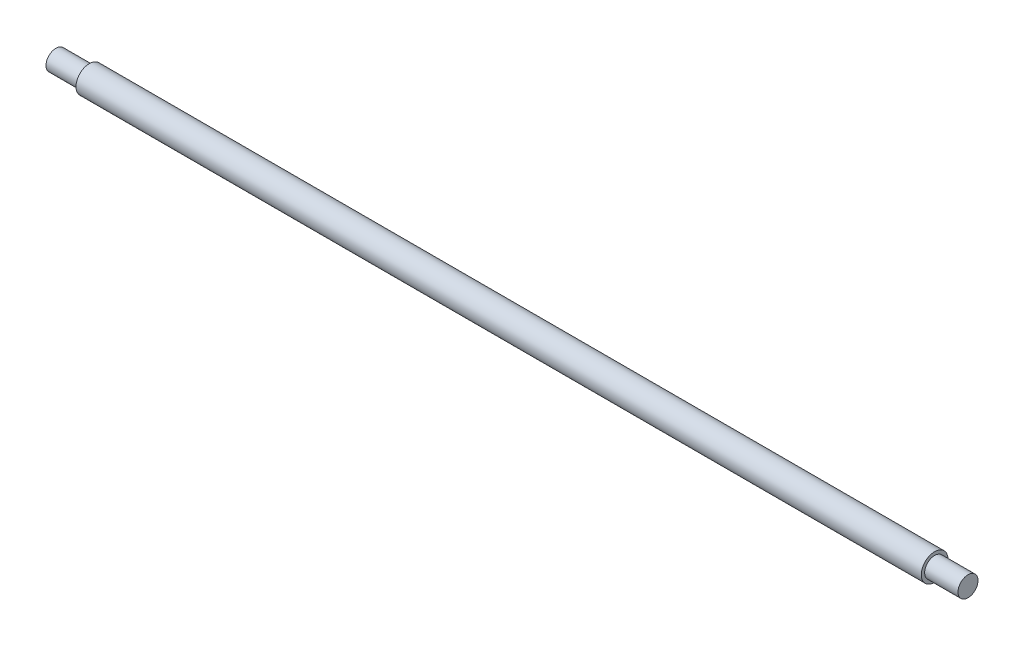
ISO-10303-21;
HEADER;
FILE_DESCRIPTION(('STEP AP214'),'2;1');
FILE_NAME('part.step','',(''),(''),'','','');
FILE_SCHEMA(('AUTOMOTIVE_DESIGN { 1 0 10303 214 1 1 1 1 }'));
ENDSEC;
DATA;
#1=APPLICATION_CONTEXT('core data for automotive mechanical design processes');
#2=APPLICATION_PROTOCOL_DEFINITION('international standard','automotive_design',2000,#1);
#3=PRODUCT_CONTEXT('',#1,'mechanical');
#4=PRODUCT('Part','Part','',(#3));
#5=PRODUCT_RELATED_PRODUCT_CATEGORY('part','',(#4));
#6=PRODUCT_DEFINITION_FORMATION('','',#4);
#7=PRODUCT_DEFINITION_CONTEXT('part definition',#1,'design');
#8=PRODUCT_DEFINITION('design','',#6,#7);
#9=PRODUCT_DEFINITION_SHAPE('','',#8);
#10=(LENGTH_UNIT() NAMED_UNIT(*) SI_UNIT(.MILLI.,.METRE.));
#11=(NAMED_UNIT(*) PLANE_ANGLE_UNIT() SI_UNIT($,.RADIAN.));
#12=(NAMED_UNIT(*) SI_UNIT($,.STERADIAN.) SOLID_ANGLE_UNIT());
#13=UNCERTAINTY_MEASURE_WITH_UNIT(LENGTH_MEASURE(1.E-05),#10,'distance_accuracy_value','');
#14=(GEOMETRIC_REPRESENTATION_CONTEXT(3) GLOBAL_UNCERTAINTY_ASSIGNED_CONTEXT((#13)) GLOBAL_UNIT_ASSIGNED_CONTEXT((#10,
#11,#12)) REPRESENTATION_CONTEXT('',''));
#15=CARTESIAN_POINT('',(0.,0.,0.));
#16=DIRECTION('',(0.,0.,1.));
#17=DIRECTION('',(1.,0.,0.));
#18=AXIS2_PLACEMENT_3D('',#15,#16,#17);
#19=CARTESIAN_POINT('',(136.75,0.,0.));
#20=DIRECTION('',(-1.,0.,0.));
#21=DIRECTION('',(0.,-1.,0.));
#22=AXIS2_PLACEMENT_3D('',#19,#20,#21);
#23=PLANE('',#22);
#24=CARTESIAN_POINT('',(136.75,0.,0.));
#25=DIRECTION('',(-1.,0.,0.));
#26=DIRECTION('',(0.,-1.,0.));
#27=AXIS2_PLACEMENT_3D('',#24,#25,#26);
#28=CIRCLE('',#27,3.);
#29=CARTESIAN_POINT('',(136.75,-3.00000000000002,0.));
#30=VERTEX_POINT('',#29);
#31=EDGE_CURVE('E10',#30,#30,#28,.T.);
#32=ORIENTED_EDGE('',*,*,#31,.F.);
#33=EDGE_LOOP('',(#32));
#34=FACE_BOUND('',#33,.T.);
#35=ADVANCED_FACE('F30',(#34),#23,.F.);
#36=CARTESIAN_POINT('',(-136.75,0.,0.));
#37=DIRECTION('',(-1.,0.,0.));
#38=DIRECTION('',(0.,-1.,0.));
#39=AXIS2_PLACEMENT_3D('',#36,#37,#38);
#40=CYLINDRICAL_SURFACE('',#39,3.);
#41=CARTESIAN_POINT('',(126.75,0.,0.));
#42=DIRECTION('',(-1.,0.,0.));
#43=DIRECTION('',(0.,-1.,0.));
#44=AXIS2_PLACEMENT_3D('',#41,#42,#43);
#45=CIRCLE('',#44,3.00000000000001);
#46=CARTESIAN_POINT('',(126.75,-3.00000000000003,0.));
#47=VERTEX_POINT('',#46);
#48=EDGE_CURVE('E36',#47,#47,#45,.T.);
#49=ORIENTED_EDGE('',*,*,#48,.F.);
#50=EDGE_LOOP('',(#49));
#51=FACE_BOUND('',#50,.T.);
#52=ORIENTED_EDGE('',*,*,#31,.T.);
#53=EDGE_LOOP('',(#52));
#54=FACE_BOUND('',#53,.T.);
#55=ADVANCED_FACE('F78',(#51,#54),#40,.T.);
#56=CARTESIAN_POINT('',(126.75,2.99999999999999,0.));
#57=DIRECTION('',(-1.,0.,0.));
#58=DIRECTION('',(0.,-1.,0.));
#59=AXIS2_PLACEMENT_3D('',#56,#57,#58);
#60=PLANE('',#59);
#61=CARTESIAN_POINT('',(126.75,0.,0.));
#62=DIRECTION('',(-1.,0.,0.));
#63=DIRECTION('',(0.,-1.,0.));
#64=AXIS2_PLACEMENT_3D('',#61,#62,#63);
#65=CIRCLE('',#64,4.00000000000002);
#66=CARTESIAN_POINT('',(126.75,-4.00000000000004,0.));
#67=VERTEX_POINT('',#66);
#68=EDGE_CURVE('E40',#67,#67,#65,.T.);
#69=ORIENTED_EDGE('',*,*,#68,.F.);
#70=EDGE_LOOP('',(#69));
#71=FACE_BOUND('',#70,.T.);
#72=ORIENTED_EDGE('',*,*,#48,.T.);
#73=EDGE_LOOP('',(#72));
#74=FACE_BOUND('',#73,.T.);
#75=ADVANCED_FACE('F73',(#71,#74),#60,.F.);
#76=CARTESIAN_POINT('',(-136.75,0.,0.));
#77=DIRECTION('',(-1.,0.,0.));
#78=DIRECTION('',(0.,-1.,0.));
#79=AXIS2_PLACEMENT_3D('',#76,#77,#78);
#80=CYLINDRICAL_SURFACE('',#79,4.00000000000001);
#81=CARTESIAN_POINT('',(-126.75,0.,0.));
#82=DIRECTION('',(-1.,0.,0.));
#83=DIRECTION('',(0.,-1.,0.));
#84=AXIS2_PLACEMENT_3D('',#81,#82,#83);
#85=CIRCLE('',#84,4.);
#86=CARTESIAN_POINT('',(-126.75,-4.00000000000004,0.));
#87=VERTEX_POINT('',#86);
#88=EDGE_CURVE('E44',#87,#87,#85,.T.);
#89=ORIENTED_EDGE('',*,*,#88,.F.);
#90=EDGE_LOOP('',(#89));
#91=FACE_BOUND('',#90,.T.);
#92=ORIENTED_EDGE('',*,*,#68,.T.);
#93=EDGE_LOOP('',(#92));
#94=FACE_BOUND('',#93,.T.);
#95=ADVANCED_FACE('F67',(#91,#94),#80,.T.);
#96=CARTESIAN_POINT('',(-126.75,2.99999999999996,0.));
#97=DIRECTION('',(1.,0.,0.));
#98=DIRECTION('',(0.,1.,0.));
#99=AXIS2_PLACEMENT_3D('',#96,#97,#98);
#100=PLANE('',#99);
#101=CARTESIAN_POINT('',(-126.75,0.,0.));
#102=DIRECTION('',(-1.,0.,0.));
#103=DIRECTION('',(0.,-1.,0.));
#104=AXIS2_PLACEMENT_3D('',#101,#102,#103);
#105=CIRCLE('',#104,2.99999999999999);
#106=CARTESIAN_POINT('',(-126.75,-3.00000000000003,0.));
#107=VERTEX_POINT('',#106);
#108=EDGE_CURVE('E49',#107,#107,#105,.T.);
#109=ORIENTED_EDGE('',*,*,#108,.F.);
#110=EDGE_LOOP('',(#109));
#111=FACE_BOUND('',#110,.T.);
#112=ORIENTED_EDGE('',*,*,#88,.T.);
#113=EDGE_LOOP('',(#112));
#114=FACE_BOUND('',#113,.T.);
#115=ADVANCED_FACE('F61',(#111,#114),#100,.F.);
#116=CARTESIAN_POINT('',(-136.75,0.,0.));
#117=DIRECTION('',(-1.,0.,0.));
#118=DIRECTION('',(0.,-1.,0.));
#119=AXIS2_PLACEMENT_3D('',#116,#117,#118);
#120=CYLINDRICAL_SURFACE('',#119,2.99999999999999);
#121=CARTESIAN_POINT('',(-136.75,0.,0.));
#122=DIRECTION('',(-1.,0.,0.));
#123=DIRECTION('',(0.,-1.,0.));
#124=AXIS2_PLACEMENT_3D('',#121,#122,#123);
#125=CIRCLE('',#124,2.99999999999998);
#126=CARTESIAN_POINT('',(-136.75,-3.00000000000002,0.));
#127=VERTEX_POINT('',#126);
#128=EDGE_CURVE('E52',#127,#127,#125,.T.);
#129=ORIENTED_EDGE('',*,*,#128,.F.);
#130=EDGE_LOOP('',(#129));
#131=FACE_BOUND('',#130,.T.);
#132=ORIENTED_EDGE('',*,*,#108,.T.);
#133=EDGE_LOOP('',(#132));
#134=FACE_BOUND('',#133,.T.);
#135=ADVANCED_FACE('F58',(#131,#134),#120,.T.);
#136=CARTESIAN_POINT('',(-136.75,0.,0.));
#137=DIRECTION('',(1.,0.,0.));
#138=DIRECTION('',(0.,1.,0.));
#139=AXIS2_PLACEMENT_3D('',#136,#137,#138);
#140=PLANE('',#139);
#141=ORIENTED_EDGE('',*,*,#128,.T.);
#142=EDGE_LOOP('',(#141));
#143=FACE_BOUND('',#142,.T.);
#144=ADVANCED_FACE('F56',(#143),#140,.F.);
#145=CLOSED_SHELL('',(#35,#55,#75,#95,#115,#135,#144));
#146=MANIFOLD_SOLID_BREP('B2',#145);
#147=ADVANCED_BREP_SHAPE_REPRESENTATION('',(#18,#146),#14);
#148=SHAPE_DEFINITION_REPRESENTATION(#9,#147);
ENDSEC;
END-ISO-10303-21;
